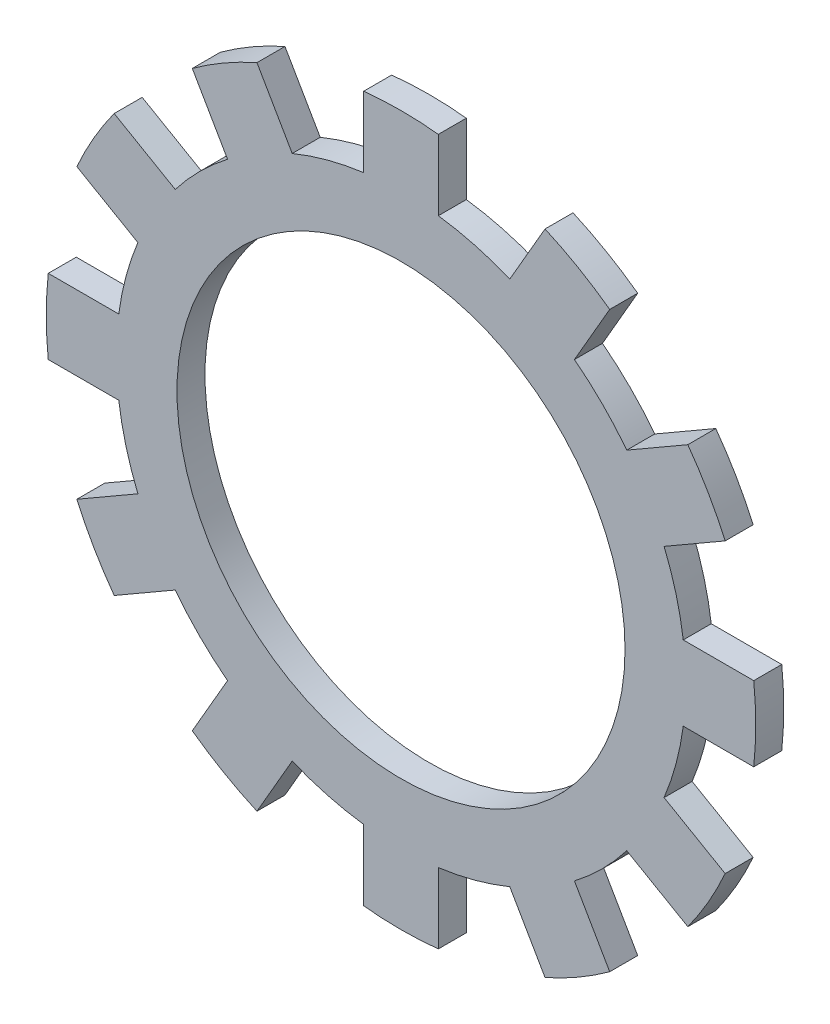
from build123d import *

# Parameters (mm, degrees)
SKETCH1_R                 = 15.25
SKETCH1_R_2               = 12
BOSS_EXTRUDE1_DEPTH       = 0.75
BOSS_EXTRUDE2_DEPTH       = 0.75
CIRPATTERN2_COUNT         = 12
CIRPATTERN2_COPY_1_DEPTH  = 0.75
CIRPATTERN2_COPY_2_DEPTH  = 0.75
CIRPATTERN2_COPY_3_DEPTH  = 0.75
CIRPATTERN2_COPY_4_DEPTH  = 0.75
CIRPATTERN2_COPY_5_DEPTH  = 0.75
CIRPATTERN2_COPY_6_DEPTH  = 0.75
CIRPATTERN2_COPY_7_DEPTH  = 0.75
CIRPATTERN2_COPY_8_DEPTH  = 0.75
CIRPATTERN2_COPY_9_DEPTH  = 0.75
CIRPATTERN2_COPY_10_DEPTH = 0.75
CIRPATTERN2_COPY_11_DEPTH = 0.75


with BuildPart() as part:
    # Sketch1 → Boss-Extrude1 (new, symmetric)
    with BuildSketch(Plane.XY):
        Circle(SKETCH1_R)
        Circle(SKETCH1_R_2, mode=Mode.SUBTRACT)
    extrude(amount=BOSS_EXTRUDE1_DEPTH, both=True)

    # Sketch3 → Boss-Extrude2 (add, symmetric)
    with BuildSketch(Plane.XY):
        with BuildLine():
            Line((-2, 18.894443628), (-2, 15.118283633))
            ThreePointArc((-2, 15.118283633), (-1.002166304, 15.21703528), (0, 15.25))
            Line((0, 15.25), (0, 19))
            ThreePointArc((0, 19), (-1.0013918, 18.973592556), (-2, 18.894443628))
        make_face()
    boss_extrude2 = extrude(amount=BOSS_EXTRUDE2_DEPTH, both=True)

    # Mirror1: Boss-Extrude2 across plane
    add(boss_extrude2.mirror(Plane(origin=(0, 0, 0), x_dir=(0, 0, 1), z_dir=(1, 0, 0))))

    # CirPattern2: Boss-Extrude2 ×12 about axis
    cirpattern2_axis = Axis((0, 0, 0), (0, 0, 1))
    for i in range(1, CIRPATTERN2_COUNT):
        add(boss_extrude2.rotate(cirpattern2_axis, i * 360 / CIRPATTERN2_COUNT))

    # CirPattern2 copy 1 sketch → CirPattern2 copy 1 (add, symmetric)
    with BuildSketch(Plane(origin=(0, 0, 0), x_dir=(-0.8660254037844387, -0.49999999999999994, 0), z_dir=(0, 0, 1))):
        with BuildLine():
            Line((-2, -18.894443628), (-2, -15.118283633))
            ThreePointArc((-2, -15.118283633), (-1.002166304, -15.21703528), (0, -15.25))
            Line((0, -15.25), (0, -19))
            ThreePointArc((0, -19), (-1.0013918, -18.973592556), (-2, -18.894443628))
        make_face()
    extrude(amount=CIRPATTERN2_COPY_1_DEPTH, both=True)

    # CirPattern2 copy 2 sketch → CirPattern2 copy 2 (add, symmetric)
    with BuildSketch(Plane(origin=(0, 0, 0), x_dir=(-0.5000000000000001, -0.8660254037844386, 0), z_dir=(0, 0, 1))):
        with BuildLine():
            Line((-2, -18.894443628), (-2, -15.118283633))
            ThreePointArc((-2, -15.118283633), (-1.002166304, -15.21703528), (0, -15.25))
            Line((0, -15.25), (0, -19))
            ThreePointArc((0, -19), (-1.0013918, -18.973592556), (-2, -18.894443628))
        make_face()
    extrude(amount=CIRPATTERN2_COPY_2_DEPTH, both=True)

    # CirPattern2 copy 3 sketch → CirPattern2 copy 3 (add, symmetric)
    with BuildSketch(Plane(origin=(0, 0, 0), x_dir=(0, -1, 0), z_dir=(0, 0, 1))):
        with BuildLine():
            Line((-2, -18.894443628), (-2, -15.118283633))
            ThreePointArc((-2, -15.118283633), (-1.002166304, -15.21703528), (0, -15.25))
            Line((0, -15.25), (0, -19))
            ThreePointArc((0, -19), (-1.0013918, -18.973592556), (-2, -18.894443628))
        make_face()
    extrude(amount=CIRPATTERN2_COPY_3_DEPTH, both=True)

    # CirPattern2 copy 4 sketch → CirPattern2 copy 4 (add, symmetric)
    with BuildSketch(Plane(origin=(0, 0, 0), x_dir=(0.4999999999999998, -0.8660254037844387, 0), z_dir=(0, 0, 1))):
        with BuildLine():
            Line((-2, -18.894443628), (-2, -15.118283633))
            ThreePointArc((-2, -15.118283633), (-1.002166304, -15.21703528), (0, -15.25))
            Line((0, -15.25), (0, -19))
            ThreePointArc((0, -19), (-1.0013918, -18.973592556), (-2, -18.894443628))
        make_face()
    extrude(amount=CIRPATTERN2_COPY_4_DEPTH, both=True)

    # CirPattern2 copy 5 sketch → CirPattern2 copy 5 (add, symmetric)
    with BuildSketch(Plane(origin=(0, 0, 0), x_dir=(0.8660254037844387, -0.49999999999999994, 0), z_dir=(0, 0, 1))):
        with BuildLine():
            Line((-2, -18.894443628), (-2, -15.118283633))
            ThreePointArc((-2, -15.118283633), (-1.002166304, -15.21703528), (0, -15.25))
            Line((0, -15.25), (0, -19))
            ThreePointArc((0, -19), (-1.0013918, -18.973592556), (-2, -18.894443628))
        make_face()
    extrude(amount=CIRPATTERN2_COPY_5_DEPTH, both=True)

    # CirPattern2 copy 6 sketch → CirPattern2 copy 6 (add, symmetric)
    with BuildSketch(Plane.XY):
        with BuildLine():
            Line((-2, -18.894443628), (-2, -15.118283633))
            ThreePointArc((-2, -15.118283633), (-1.002166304, -15.21703528), (0, -15.25))
            Line((0, -15.25), (0, -19))
            ThreePointArc((0, -19), (-1.0013918, -18.973592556), (-2, -18.894443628))
        make_face()
    extrude(amount=CIRPATTERN2_COPY_6_DEPTH, both=True)

    # CirPattern2 copy 7 sketch → CirPattern2 copy 7 (add, symmetric)
    with BuildSketch(Plane(origin=(0, 0, 0), x_dir=(0.8660254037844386, 0.5000000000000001, 0), z_dir=(0, 0, 1))):
        with BuildLine():
            Line((-2, -18.894443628), (-2, -15.118283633))
            ThreePointArc((-2, -15.118283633), (-1.002166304, -15.21703528), (0, -15.25))
            Line((0, -15.25), (0, -19))
            ThreePointArc((0, -19), (-1.0013918, -18.973592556), (-2, -18.894443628))
        make_face()
    extrude(amount=CIRPATTERN2_COPY_7_DEPTH, both=True)

    # CirPattern2 copy 8 sketch → CirPattern2 copy 8 (add, symmetric)
    with BuildSketch(Plane(origin=(0, 0, 0), x_dir=(0.5000000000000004, 0.8660254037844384, 0), z_dir=(0, 0, 1))):
        with BuildLine():
            Line((-2, -18.894443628), (-2, -15.118283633))
            ThreePointArc((-2, -15.118283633), (-1.002166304, -15.21703528), (0, -15.25))
            Line((0, -15.25), (0, -19))
            ThreePointArc((0, -19), (-1.0013918, -18.973592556), (-2, -18.894443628))
        make_face()
    extrude(amount=CIRPATTERN2_COPY_8_DEPTH, both=True)

    # CirPattern2 copy 9 sketch → CirPattern2 copy 9 (add, symmetric)
    with BuildSketch(Plane(origin=(0, 0, 0), x_dir=(0, 1, 0), z_dir=(0, 0, 1))):
        with BuildLine():
            Line((-2, -18.894443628), (-2, -15.118283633))
            ThreePointArc((-2, -15.118283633), (-1.002166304, -15.21703528), (0, -15.25))
            Line((0, -15.25), (0, -19))
            ThreePointArc((0, -19), (-1.0013918, -18.973592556), (-2, -18.894443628))
        make_face()
    extrude(amount=CIRPATTERN2_COPY_9_DEPTH, both=True)

    # CirPattern2 copy 10 sketch → CirPattern2 copy 10 (add, symmetric)
    with BuildSketch(Plane(origin=(0, 0, 0), x_dir=(-0.5000000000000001, 0.8660254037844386, 0), z_dir=(0, 0, 1))):
        with BuildLine():
            Line((-2, -18.894443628), (-2, -15.118283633))
            ThreePointArc((-2, -15.118283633), (-1.002166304, -15.21703528), (0, -15.25))
            Line((0, -15.25), (0, -19))
            ThreePointArc((0, -19), (-1.0013918, -18.973592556), (-2, -18.894443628))
        make_face()
    extrude(amount=CIRPATTERN2_COPY_10_DEPTH, both=True)

    # CirPattern2 copy 11 sketch → CirPattern2 copy 11 (add, symmetric)
    with BuildSketch(Plane(origin=(0, 0, 0), x_dir=(-0.8660254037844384, 0.5000000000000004, 0), z_dir=(0, 0, 1))):
        with BuildLine():
            Line((-2, -18.894443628), (-2, -15.118283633))
            ThreePointArc((-2, -15.118283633), (-1.002166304, -15.21703528), (0, -15.25))
            Line((0, -15.25), (0, -19))
            ThreePointArc((0, -19), (-1.0013918, -18.973592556), (-2, -18.894443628))
        make_face()
    extrude(amount=CIRPATTERN2_COPY_11_DEPTH, both=True)


solid = part.part
